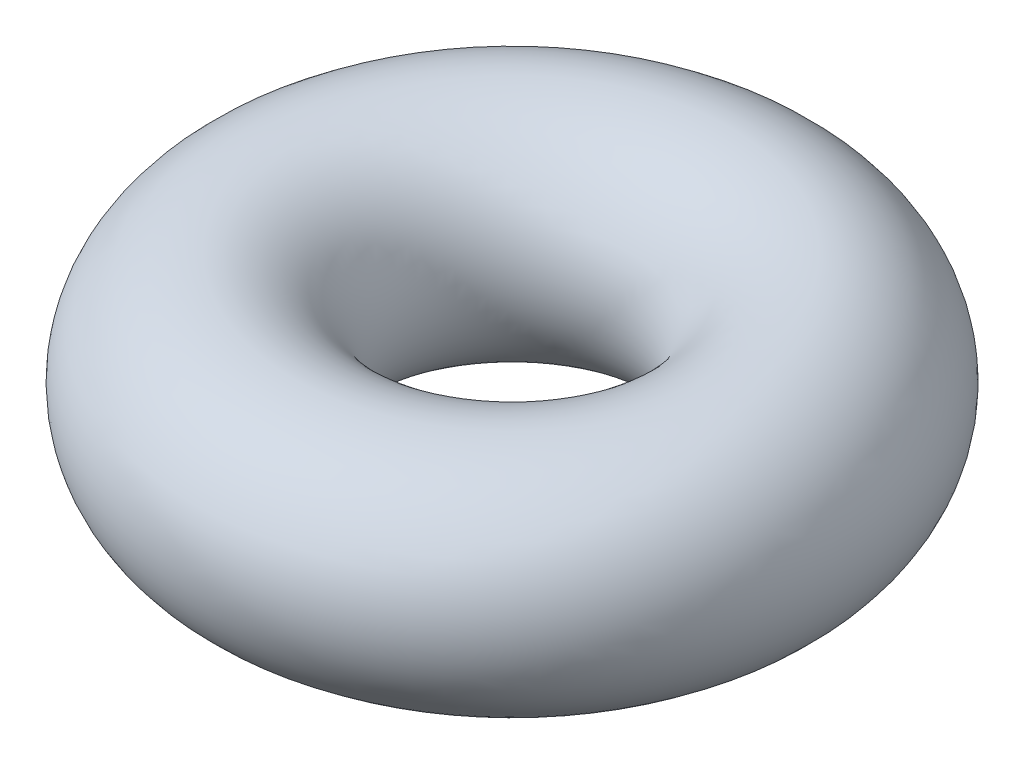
ISO-10303-21;
HEADER;
FILE_DESCRIPTION(('STEP AP214'),'2;1');
FILE_NAME('part.step','',(''),(''),'','','');
FILE_SCHEMA(('AUTOMOTIVE_DESIGN { 1 0 10303 214 1 1 1 1 }'));
ENDSEC;
DATA;
#1=APPLICATION_CONTEXT('core data for automotive mechanical design processes');
#2=APPLICATION_PROTOCOL_DEFINITION('international standard','automotive_design',2000,#1);
#3=PRODUCT_CONTEXT('',#1,'mechanical');
#4=PRODUCT('Part','Part','',(#3));
#5=PRODUCT_RELATED_PRODUCT_CATEGORY('part','',(#4));
#6=PRODUCT_DEFINITION_FORMATION('','',#4);
#7=PRODUCT_DEFINITION_CONTEXT('part definition',#1,'design');
#8=PRODUCT_DEFINITION('design','',#6,#7);
#9=PRODUCT_DEFINITION_SHAPE('','',#8);
#10=(LENGTH_UNIT() NAMED_UNIT(*) SI_UNIT(.MILLI.,.METRE.));
#11=(NAMED_UNIT(*) PLANE_ANGLE_UNIT() SI_UNIT($,.RADIAN.));
#12=(NAMED_UNIT(*) SI_UNIT($,.STERADIAN.) SOLID_ANGLE_UNIT());
#13=UNCERTAINTY_MEASURE_WITH_UNIT(LENGTH_MEASURE(1.E-05),#10,'distance_accuracy_value','');
#14=(GEOMETRIC_REPRESENTATION_CONTEXT(3) GLOBAL_UNCERTAINTY_ASSIGNED_CONTEXT((#13)) GLOBAL_UNIT_ASSIGNED_CONTEXT((#10,
#11,#12)) REPRESENTATION_CONTEXT('',''));
#15=CARTESIAN_POINT('',(0.,0.,0.));
#16=DIRECTION('',(0.,0.,1.));
#17=DIRECTION('',(1.,0.,0.));
#18=AXIS2_PLACEMENT_3D('',#15,#16,#17);
#19=CARTESIAN_POINT('',(141.53011054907,0.,0.));
#20=DIRECTION('',(0.,1.,0.));
#21=DIRECTION('',(0.,0.,1.));
#22=AXIS2_PLACEMENT_3D('',#19,#20,#21);
#23=TOROIDAL_SURFACE('',#22,141.53011054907,72.5);
#24=CARTESIAN_POINT('',(141.53011054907,0.,214.03011054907));
#25=VERTEX_POINT('',#24);
#26=VERTEX_LOOP('',#25);
#27=FACE_BOUND('',#26,.T.);
#28=ADVANCED_FACE('F30',(#27),#23,.T.);
#29=CLOSED_SHELL('',(#28));
#30=CARTESIAN_POINT('',(141.53011054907,0.,0.));
#31=DIRECTION('',(0.,1.,0.));
#32=DIRECTION('',(0.,0.,1.));
#33=AXIS2_PLACEMENT_3D('',#30,#31,#32);
#34=TOROIDAL_SURFACE('',#33,141.53011054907,62.5);
#35=CARTESIAN_POINT('',(141.53011054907,0.,204.03011054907));
#36=VERTEX_POINT('',#35);
#37=VERTEX_LOOP('',#36);
#38=FACE_BOUND('',#37,.T.);
#39=ADVANCED_FACE('F42',(#38),#34,.F.);
#40=CLOSED_SHELL('',(#39));
#41=ORIENTED_CLOSED_SHELL('',*,#40,.T.);
#42=BREP_WITH_VOIDS('B2',#29,(#41));
#43=ADVANCED_BREP_SHAPE_REPRESENTATION('',(#18,#42),#14);
#44=SHAPE_DEFINITION_REPRESENTATION(#9,#43);
ENDSEC;
END-ISO-10303-21;
